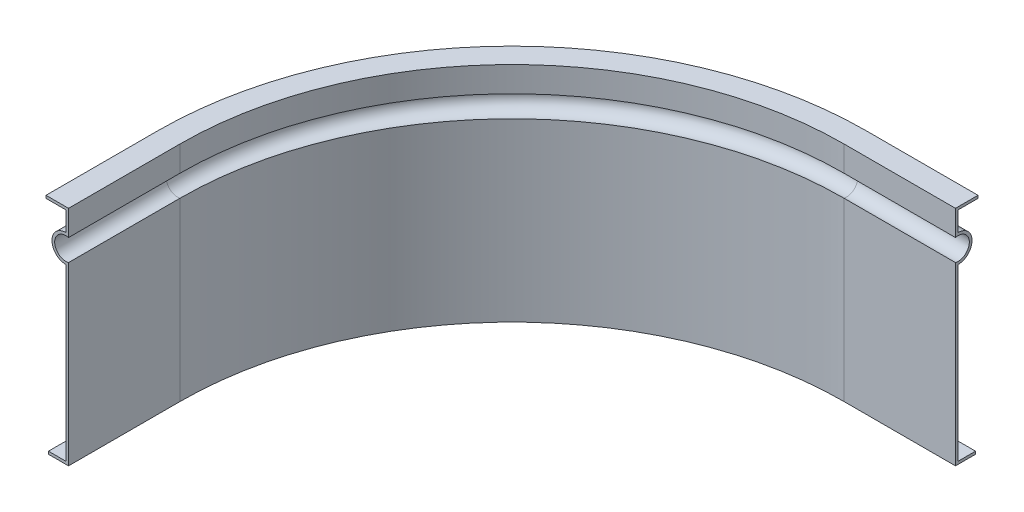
ISO-10303-21;
HEADER;
FILE_DESCRIPTION(('STEP AP214'),'2;1');
FILE_NAME('part.step','',(''),(''),'','','');
FILE_SCHEMA(('AUTOMOTIVE_DESIGN { 1 0 10303 214 1 1 1 1 }'));
ENDSEC;
DATA;
#1=APPLICATION_CONTEXT('core data for automotive mechanical design processes');
#2=APPLICATION_PROTOCOL_DEFINITION('international standard','automotive_design',2000,#1);
#3=PRODUCT_CONTEXT('',#1,'mechanical');
#4=PRODUCT('Part','Part','',(#3));
#5=PRODUCT_RELATED_PRODUCT_CATEGORY('part','',(#4));
#6=PRODUCT_DEFINITION_FORMATION('','',#4);
#7=PRODUCT_DEFINITION_CONTEXT('part definition',#1,'design');
#8=PRODUCT_DEFINITION('design','',#6,#7);
#9=PRODUCT_DEFINITION_SHAPE('','',#8);
#10=(LENGTH_UNIT() NAMED_UNIT(*) SI_UNIT(.MILLI.,.METRE.));
#11=(NAMED_UNIT(*) PLANE_ANGLE_UNIT() SI_UNIT($,.RADIAN.));
#12=(NAMED_UNIT(*) SI_UNIT($,.STERADIAN.) SOLID_ANGLE_UNIT());
#13=UNCERTAINTY_MEASURE_WITH_UNIT(LENGTH_MEASURE(1.E-05),#10,'distance_accuracy_value','');
#14=(GEOMETRIC_REPRESENTATION_CONTEXT(3) GLOBAL_UNCERTAINTY_ASSIGNED_CONTEXT((#13)) GLOBAL_UNIT_ASSIGNED_CONTEXT((#10,
#11,#12)) REPRESENTATION_CONTEXT('',''));
#15=CARTESIAN_POINT('',(0.,0.,0.));
#16=DIRECTION('',(0.,0.,1.));
#17=DIRECTION('',(1.,0.,0.));
#18=AXIS2_PLACEMENT_3D('',#15,#16,#17);
#19=CARTESIAN_POINT('',(147.572,77.7216181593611,-198.786));
#20=DIRECTION('',(0.,0.,-1.));
#21=DIRECTION('',(0.,1.,0.));
#22=AXIS2_PLACEMENT_3D('',#19,#20,#21);
#23=PLANE('',#22);
#24=DIRECTION('',(0.,1.,0.));
#25=VECTOR('',#24,1.);
#26=CARTESIAN_POINT('',(147.572,77.7216181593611,-198.786));
#27=LINE('',#26,#25);
#28=CARTESIAN_POINT('',(147.572,-1.214,-198.786));
#29=VERTEX_POINT('',#28);
#30=CARTESIAN_POINT('',(147.572,77.7216181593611,-198.786));
#31=VERTEX_POINT('',#30);
#32=EDGE_CURVE('E204',#29,#31,#27,.T.);
#33=ORIENTED_EDGE('',*,*,#32,.F.);
#34=DIRECTION('',(1.,0.,0.));
#35=VECTOR('',#34,1.);
#36=CARTESIAN_POINT('',(147.572,-1.214,-198.786));
#37=LINE('',#36,#35);
#38=CARTESIAN_POINT('',(197.572,-1.214,-198.786));
#39=VERTEX_POINT('',#38);
#40=EDGE_CURVE('E37',#29,#39,#37,.T.);
#41=ORIENTED_EDGE('',*,*,#40,.T.);
#42=DIRECTION('',(0.,1.,0.));
#43=VECTOR('',#42,1.);
#44=CARTESIAN_POINT('',(197.572,77.7216181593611,-198.786));
#45=LINE('',#44,#43);
#46=CARTESIAN_POINT('',(197.572,77.7216181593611,-198.786));
#47=VERTEX_POINT('',#46);
#48=EDGE_CURVE('E44',#39,#47,#45,.T.);
#49=ORIENTED_EDGE('',*,*,#48,.T.);
#50=DIRECTION('',(1.,0.,0.));
#51=VECTOR('',#50,1.);
#52=CARTESIAN_POINT('',(147.572,77.7216181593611,-198.786));
#53=LINE('',#52,#51);
#54=EDGE_CURVE('E11',#31,#47,#53,.T.);
#55=ORIENTED_EDGE('',*,*,#54,.F.);
#56=EDGE_LOOP('',(#33,#41,#49,#55));
#57=FACE_BOUND('',#56,.T.);
#58=ADVANCED_FACE('F30',(#57),#23,.F.);
#59=CARTESIAN_POINT('',(147.572,0.,-207.786));
#60=DIRECTION('',(0.,0.,1.));
#61=DIRECTION('',(1.,0.,0.));
#62=AXIS2_PLACEMENT_3D('',#59,#60,#61);
#63=PLANE('',#62);
#64=DIRECTION('',(0.,-1.,0.));
#65=VECTOR('',#64,1.);
#66=CARTESIAN_POINT('',(147.572,0.,-207.786));
#67=LINE('',#66,#65);
#68=CARTESIAN_POINT('',(147.572,0.,-207.786));
#69=VERTEX_POINT('',#68);
#70=CARTESIAN_POINT('',(147.572,-1.214,-207.786));
#71=VERTEX_POINT('',#70);
#72=EDGE_CURVE('E314',#69,#71,#67,.T.);
#73=ORIENTED_EDGE('',*,*,#72,.F.);
#74=DIRECTION('',(1.,0.,0.));
#75=VECTOR('',#74,1.);
#76=CARTESIAN_POINT('',(147.572,0.,-207.786));
#77=LINE('',#76,#75);
#78=CARTESIAN_POINT('',(197.572,0.,-207.786));
#79=VERTEX_POINT('',#78);
#80=EDGE_CURVE('E395',#69,#79,#77,.T.);
#81=ORIENTED_EDGE('',*,*,#80,.T.);
#82=DIRECTION('',(0.,-1.,0.));
#83=VECTOR('',#82,1.);
#84=CARTESIAN_POINT('',(197.572,0.,-207.786));
#85=LINE('',#84,#83);
#86=CARTESIAN_POINT('',(197.572,-1.214,-207.786));
#87=VERTEX_POINT('',#86);
#88=EDGE_CURVE('E367',#79,#87,#85,.T.);
#89=ORIENTED_EDGE('',*,*,#88,.T.);
#90=DIRECTION('',(1.,0.,0.));
#91=VECTOR('',#90,1.);
#92=CARTESIAN_POINT('',(147.572,-1.214,-207.786));
#93=LINE('',#92,#91);
#94=EDGE_CURVE('E398',#71,#87,#93,.T.);
#95=ORIENTED_EDGE('',*,*,#94,.F.);
#96=EDGE_LOOP('',(#73,#81,#89,#95));
#97=FACE_BOUND('',#96,.T.);
#98=ADVANCED_FACE('F421',(#97),#63,.F.);
#99=CARTESIAN_POINT('',(147.572,76.358,-200.));
#100=DIRECTION('',(0.,0.,1.));
#101=DIRECTION('',(0.,-1.,0.));
#102=AXIS2_PLACEMENT_3D('',#99,#100,#101);
#103=PLANE('',#102);
#104=DIRECTION('',(0.,-1.,0.));
#105=VECTOR('',#104,1.);
#106=CARTESIAN_POINT('',(147.572,76.358,-200.));
#107=LINE('',#106,#105);
#108=CARTESIAN_POINT('',(147.572,76.358,-200.));
#109=VERTEX_POINT('',#108);
#110=CARTESIAN_POINT('',(147.572,0.,-200.));
#111=VERTEX_POINT('',#110);
#112=EDGE_CURVE('E311',#109,#111,#107,.T.);
#113=ORIENTED_EDGE('',*,*,#112,.F.);
#114=DIRECTION('',(1.,0.,0.));
#115=VECTOR('',#114,1.);
#116=CARTESIAN_POINT('',(147.572,76.358,-200.));
#117=LINE('',#116,#115);
#118=CARTESIAN_POINT('',(197.572,76.358,-200.));
#119=VERTEX_POINT('',#118);
#120=EDGE_CURVE('E389',#109,#119,#117,.T.);
#121=ORIENTED_EDGE('',*,*,#120,.T.);
#122=DIRECTION('',(0.,-1.,0.));
#123=VECTOR('',#122,1.);
#124=CARTESIAN_POINT('',(197.572,76.358,-200.));
#125=LINE('',#124,#123);
#126=CARTESIAN_POINT('',(197.572,0.,-200.));
#127=VERTEX_POINT('',#126);
#128=EDGE_CURVE('E363',#119,#127,#125,.T.);
#129=ORIENTED_EDGE('',*,*,#128,.T.);
#130=DIRECTION('',(1.,0.,0.));
#131=VECTOR('',#130,1.);
#132=CARTESIAN_POINT('',(147.572,0.,-200.));
#133=LINE('',#132,#131);
#134=EDGE_CURVE('E392',#111,#127,#133,.T.);
#135=ORIENTED_EDGE('',*,*,#134,.F.);
#136=EDGE_LOOP('',(#113,#121,#129,#135));
#137=FACE_BOUND('',#136,.T.);
#138=ADVANCED_FACE('F469',(#137),#103,.F.);
#139=CARTESIAN_POINT('',(147.572,82.572,-200.));
#140=DIRECTION('',(1.,0.,0.));
#141=DIRECTION('',(0.,0.,-1.));
#142=AXIS2_PLACEMENT_3D('',#139,#140,#141);
#143=CYLINDRICAL_SURFACE('',#142,6.214);
#144=CARTESIAN_POINT('',(147.572,82.572,-200.));
#145=DIRECTION('',(-1.,0.,0.));
#146=DIRECTION('',(0.,0.,1.));
#147=AXIS2_PLACEMENT_3D('',#144,#145,#146);
#148=CIRCLE('',#147,6.214);
#149=CARTESIAN_POINT('',(147.572,88.786,-200.));
#150=VERTEX_POINT('',#149);
#151=EDGE_CURVE('E308',#150,#109,#148,.T.);
#152=ORIENTED_EDGE('',*,*,#151,.F.);
#153=DIRECTION('',(1.,0.,0.));
#154=VECTOR('',#153,1.);
#155=CARTESIAN_POINT('',(147.572,88.786,-200.));
#156=LINE('',#155,#154);
#157=CARTESIAN_POINT('',(197.572,88.786,-200.));
#158=VERTEX_POINT('',#157);
#159=EDGE_CURVE('E386',#150,#158,#156,.T.);
#160=ORIENTED_EDGE('',*,*,#159,.T.);
#161=CARTESIAN_POINT('',(197.572,82.572,-200.));
#162=DIRECTION('',(-1.,0.,0.));
#163=DIRECTION('',(0.,0.,1.));
#164=AXIS2_PLACEMENT_3D('',#161,#162,#163);
#165=CIRCLE('',#164,6.214);
#166=EDGE_CURVE('E361',#158,#119,#165,.T.);
#167=ORIENTED_EDGE('',*,*,#166,.T.);
#168=ORIENTED_EDGE('',*,*,#120,.F.);
#169=EDGE_LOOP('',(#152,#160,#167,#168));
#170=FACE_BOUND('',#169,.T.);
#171=ADVANCED_FACE('F472',(#170),#143,.T.);
#172=CARTESIAN_POINT('',(147.572,97.572,-200.));
#173=DIRECTION('',(0.,0.,1.));
#174=DIRECTION('',(0.,-1.,0.));
#175=AXIS2_PLACEMENT_3D('',#172,#173,#174);
#176=PLANE('',#175);
#177=DIRECTION('',(0.,-1.,0.));
#178=VECTOR('',#177,1.);
#179=CARTESIAN_POINT('',(147.572,97.572,-200.));
#180=LINE('',#179,#178);
#181=CARTESIAN_POINT('',(147.572,97.572,-200.));
#182=VERTEX_POINT('',#181);
#183=EDGE_CURVE('E305',#182,#150,#180,.T.);
#184=ORIENTED_EDGE('',*,*,#183,.F.);
#185=DIRECTION('',(1.,0.,0.));
#186=VECTOR('',#185,1.);
#187=CARTESIAN_POINT('',(147.572,97.572,-200.));
#188=LINE('',#187,#186);
#189=CARTESIAN_POINT('',(197.572,97.572,-200.));
#190=VERTEX_POINT('',#189);
#191=EDGE_CURVE('E383',#182,#190,#188,.T.);
#192=ORIENTED_EDGE('',*,*,#191,.T.);
#193=DIRECTION('',(0.,-1.,0.));
#194=VECTOR('',#193,1.);
#195=CARTESIAN_POINT('',(197.572,97.572,-200.));
#196=LINE('',#195,#194);
#197=EDGE_CURVE('E359',#190,#158,#196,.T.);
#198=ORIENTED_EDGE('',*,*,#197,.T.);
#199=ORIENTED_EDGE('',*,*,#159,.F.);
#200=EDGE_LOOP('',(#184,#192,#198,#199));
#201=FACE_BOUND('',#200,.T.);
#202=ADVANCED_FACE('F475',(#201),#176,.F.);
#203=CARTESIAN_POINT('',(147.572,98.786,-208.890059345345));
#204=DIRECTION('',(0.,0.,1.));
#205=DIRECTION('',(1.,0.,0.));
#206=AXIS2_PLACEMENT_3D('',#203,#204,#205);
#207=PLANE('',#206);
#208=DIRECTION('',(0.,-1.,0.));
#209=VECTOR('',#208,1.);
#210=CARTESIAN_POINT('',(147.572,98.786,-208.890059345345));
#211=LINE('',#210,#209);
#212=CARTESIAN_POINT('',(147.572,98.786,-208.890059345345));
#213=VERTEX_POINT('',#212);
#214=CARTESIAN_POINT('',(147.572,97.572,-208.890059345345));
#215=VERTEX_POINT('',#214);
#216=EDGE_CURVE('E302',#213,#215,#211,.T.);
#217=ORIENTED_EDGE('',*,*,#216,.F.);
#218=DIRECTION('',(1.,0.,0.));
#219=VECTOR('',#218,1.);
#220=CARTESIAN_POINT('',(147.572,98.786,-208.890059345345));
#221=LINE('',#220,#219);
#222=CARTESIAN_POINT('',(197.572,98.786,-208.890059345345));
#223=VERTEX_POINT('',#222);
#224=EDGE_CURVE('E377',#213,#223,#221,.T.);
#225=ORIENTED_EDGE('',*,*,#224,.T.);
#226=DIRECTION('',(0.,-1.,0.));
#227=VECTOR('',#226,1.);
#228=CARTESIAN_POINT('',(197.572,98.786,-208.890059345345));
#229=LINE('',#228,#227);
#230=CARTESIAN_POINT('',(197.572,97.572,-208.890059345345));
#231=VERTEX_POINT('',#230);
#232=EDGE_CURVE('E355',#223,#231,#229,.T.);
#233=ORIENTED_EDGE('',*,*,#232,.T.);
#234=DIRECTION('',(1.,0.,0.));
#235=VECTOR('',#234,1.);
#236=CARTESIAN_POINT('',(147.572,97.572,-208.890059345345));
#237=LINE('',#236,#235);
#238=EDGE_CURVE('E380',#215,#231,#237,.T.);
#239=ORIENTED_EDGE('',*,*,#238,.F.);
#240=EDGE_LOOP('',(#217,#225,#233,#239));
#241=FACE_BOUND('',#240,.T.);
#242=ADVANCED_FACE('F480',(#241),#207,.F.);
#243=CARTESIAN_POINT('',(147.572,98.786,-198.786));
#244=DIRECTION('',(0.,0.,-1.));
#245=DIRECTION('',(0.,1.,0.));
#246=AXIS2_PLACEMENT_3D('',#243,#244,#245);
#247=PLANE('',#246);
#248=DIRECTION('',(0.,1.,0.));
#249=VECTOR('',#248,1.);
#250=CARTESIAN_POINT('',(147.572,98.786,-198.786));
#251=LINE('',#250,#249);
#252=CARTESIAN_POINT('',(147.572,87.4223818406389,-198.786));
#253=VERTEX_POINT('',#252);
#254=CARTESIAN_POINT('',(147.572,98.786,-198.786));
#255=VERTEX_POINT('',#254);
#256=EDGE_CURVE('E300',#253,#255,#251,.T.);
#257=ORIENTED_EDGE('',*,*,#256,.F.);
#258=DIRECTION('',(1.,0.,0.));
#259=VECTOR('',#258,1.);
#260=CARTESIAN_POINT('',(147.572,87.4223818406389,-198.786));
#261=LINE('',#260,#259);
#262=CARTESIAN_POINT('',(197.572,87.4223818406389,-198.786));
#263=VERTEX_POINT('',#262);
#264=EDGE_CURVE('E371',#253,#263,#261,.T.);
#265=ORIENTED_EDGE('',*,*,#264,.T.);
#266=DIRECTION('',(0.,1.,0.));
#267=VECTOR('',#266,1.);
#268=CARTESIAN_POINT('',(197.572,98.786,-198.786));
#269=LINE('',#268,#267);
#270=CARTESIAN_POINT('',(197.572,98.786,-198.786));
#271=VERTEX_POINT('',#270);
#272=EDGE_CURVE('E351',#263,#271,#269,.T.);
#273=ORIENTED_EDGE('',*,*,#272,.T.);
#274=DIRECTION('',(1.,0.,0.));
#275=VECTOR('',#274,1.);
#276=CARTESIAN_POINT('',(147.572,98.786,-198.786));
#277=LINE('',#276,#275);
#278=EDGE_CURVE('E374',#255,#271,#277,.T.);
#279=ORIENTED_EDGE('',*,*,#278,.F.);
#280=EDGE_LOOP('',(#257,#265,#273,#279));
#281=FACE_BOUND('',#280,.T.);
#282=ADVANCED_FACE('F432',(#281),#247,.F.);
#283=CARTESIAN_POINT('',(147.572,82.572,-200.));
#284=DIRECTION('',(1.,0.,0.));
#285=DIRECTION('',(0.,0.,-1.));
#286=AXIS2_PLACEMENT_3D('',#283,#284,#285);
#287=CYLINDRICAL_SURFACE('',#286,5.);
#288=CARTESIAN_POINT('',(147.572,82.572,-200.));
#289=DIRECTION('',(1.,0.,0.));
#290=DIRECTION('',(0.,0.,1.));
#291=AXIS2_PLACEMENT_3D('',#288,#289,#290);
#292=CIRCLE('',#291,5.);
#293=EDGE_CURVE('E200',#31,#253,#292,.T.);
#294=ORIENTED_EDGE('',*,*,#293,.F.);
#295=ORIENTED_EDGE('',*,*,#54,.T.);
#296=CARTESIAN_POINT('',(197.572,82.572,-200.));
#297=DIRECTION('',(1.,0.,0.));
#298=DIRECTION('',(0.,0.,1.));
#299=AXIS2_PLACEMENT_3D('',#296,#297,#298);
#300=CIRCLE('',#299,5.);
#301=EDGE_CURVE('E349',#47,#263,#300,.T.);
#302=ORIENTED_EDGE('',*,*,#301,.T.);
#303=ORIENTED_EDGE('',*,*,#264,.F.);
#304=EDGE_LOOP('',(#294,#295,#302,#303));
#305=FACE_BOUND('',#304,.T.);
#306=ADVANCED_FACE('F429',(#305),#287,.F.);
#307=CARTESIAN_POINT('',(147.572,0.,-50.));
#308=DIRECTION('',(0.,-1.,0.));
#309=DIRECTION('',(0.,0.,-1.));
#310=AXIS2_PLACEMENT_3D('',#307,#308,#309);
#311=CYLINDRICAL_SURFACE('',#310,148.786);
#312=DIRECTION('',(0.,1.,0.));
#313=VECTOR('',#312,1.);
#314=CARTESIAN_POINT('',(-1.21400000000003,77.7216181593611,-50.));
#315=LINE('',#314,#313);
#316=CARTESIAN_POINT('',(-1.214,-1.214,-50.));
#317=VERTEX_POINT('',#316);
#318=CARTESIAN_POINT('',(-1.21400000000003,77.7216181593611,-50.));
#319=VERTEX_POINT('',#318);
#320=EDGE_CURVE('E224',#317,#319,#315,.T.);
#321=ORIENTED_EDGE('',*,*,#320,.F.);
#322=CARTESIAN_POINT('',(147.572,-1.214,-50.));
#323=DIRECTION('',(0.,-1.,0.));
#324=DIRECTION('',(0.,0.,-1.));
#325=AXIS2_PLACEMENT_3D('',#322,#323,#324);
#326=CIRCLE('',#325,148.786);
#327=EDGE_CURVE('E344',#317,#29,#326,.T.);
#328=ORIENTED_EDGE('',*,*,#327,.T.);
#329=ORIENTED_EDGE('',*,*,#32,.T.);
#330=CARTESIAN_POINT('',(147.572,77.7216181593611,-50.));
#331=DIRECTION('',(0.,-1.,0.));
#332=DIRECTION('',(0.,0.,-1.));
#333=AXIS2_PLACEMENT_3D('',#330,#331,#332);
#334=CIRCLE('',#333,148.786);
#335=EDGE_CURVE('E347',#319,#31,#334,.T.);
#336=ORIENTED_EDGE('',*,*,#335,.F.);
#337=EDGE_LOOP('',(#321,#328,#329,#336));
#338=FACE_BOUND('',#337,.T.);
#339=ADVANCED_FACE('F405',(#338),#311,.F.);
#340=CARTESIAN_POINT('',(147.572,0.,-50.));
#341=DIRECTION('',(0.,-1.,0.));
#342=DIRECTION('',(0.,0.,-1.));
#343=AXIS2_PLACEMENT_3D('',#340,#341,#342);
#344=CYLINDRICAL_SURFACE('',#343,157.786);
#345=DIRECTION('',(0.,-1.,0.));
#346=VECTOR('',#345,1.);
#347=CARTESIAN_POINT('',(-10.214,0.,-50.));
#348=LINE('',#347,#346);
#349=CARTESIAN_POINT('',(-10.214,0.,-50.));
#350=VERTEX_POINT('',#349);
#351=CARTESIAN_POINT('',(-10.214,-1.214,-50.));
#352=VERTEX_POINT('',#351);
#353=EDGE_CURVE('E246',#350,#352,#348,.T.);
#354=ORIENTED_EDGE('',*,*,#353,.F.);
#355=CARTESIAN_POINT('',(147.572,0.,-50.));
#356=DIRECTION('',(0.,-1.,0.));
#357=DIRECTION('',(0.,0.,-1.));
#358=AXIS2_PLACEMENT_3D('',#355,#356,#357);
#359=CIRCLE('',#358,157.786);
#360=EDGE_CURVE('E338',#350,#69,#359,.T.);
#361=ORIENTED_EDGE('',*,*,#360,.T.);
#362=ORIENTED_EDGE('',*,*,#72,.T.);
#363=CARTESIAN_POINT('',(147.572,-1.214,-50.));
#364=DIRECTION('',(0.,-1.,0.));
#365=DIRECTION('',(0.,0.,-1.));
#366=AXIS2_PLACEMENT_3D('',#363,#364,#365);
#367=CIRCLE('',#366,157.786);
#368=EDGE_CURVE('E341',#352,#71,#367,.T.);
#369=ORIENTED_EDGE('',*,*,#368,.F.);
#370=EDGE_LOOP('',(#354,#361,#362,#369));
#371=FACE_BOUND('',#370,.T.);
#372=ADVANCED_FACE('F418',(#371),#344,.T.);
#373=CARTESIAN_POINT('',(147.572,0.,-50.));
#374=DIRECTION('',(0.,-1.,0.));
#375=DIRECTION('',(0.,0.,-1.));
#376=AXIS2_PLACEMENT_3D('',#373,#374,#375);
#377=CYLINDRICAL_SURFACE('',#376,150.);
#378=DIRECTION('',(0.,-1.,0.));
#379=VECTOR('',#378,1.);
#380=CARTESIAN_POINT('',(-2.42800000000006,76.358,-50.));
#381=LINE('',#380,#379);
#382=CARTESIAN_POINT('',(-2.42800000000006,76.358,-50.));
#383=VERTEX_POINT('',#382);
#384=CARTESIAN_POINT('',(-2.42800000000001,0.,-50.));
#385=VERTEX_POINT('',#384);
#386=EDGE_CURVE('E243',#383,#385,#381,.T.);
#387=ORIENTED_EDGE('',*,*,#386,.F.);
#388=CARTESIAN_POINT('',(147.572,76.358,-50.));
#389=DIRECTION('',(0.,-1.,0.));
#390=DIRECTION('',(0.,0.,-1.));
#391=AXIS2_PLACEMENT_3D('',#388,#389,#390);
#392=CIRCLE('',#391,150.);
#393=EDGE_CURVE('E332',#383,#109,#392,.T.);
#394=ORIENTED_EDGE('',*,*,#393,.T.);
#395=ORIENTED_EDGE('',*,*,#112,.T.);
#396=CARTESIAN_POINT('',(147.572,0.,-50.));
#397=DIRECTION('',(0.,-1.,0.));
#398=DIRECTION('',(0.,0.,-1.));
#399=AXIS2_PLACEMENT_3D('',#396,#397,#398);
#400=CIRCLE('',#399,150.);
#401=EDGE_CURVE('E335',#385,#111,#400,.T.);
#402=ORIENTED_EDGE('',*,*,#401,.F.);
#403=EDGE_LOOP('',(#387,#394,#395,#402));
#404=FACE_BOUND('',#403,.T.);
#405=ADVANCED_FACE('F517',(#404),#377,.T.);
#406=CARTESIAN_POINT('',(147.572,82.572,-50.));
#407=DIRECTION('',(0.,-1.,0.));
#408=DIRECTION('',(0.,0.,-1.));
#409=AXIS2_PLACEMENT_3D('',#406,#407,#408);
#410=TOROIDAL_SURFACE('',#409,150.,6.214);
#411=CARTESIAN_POINT('',(-2.42800000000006,82.572,-50.));
#412=DIRECTION('',(0.,0.,1.));
#413=DIRECTION('',(1.,0.,0.));
#414=AXIS2_PLACEMENT_3D('',#411,#412,#413);
#415=CIRCLE('',#414,6.214);
#416=CARTESIAN_POINT('',(-2.42800000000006,88.786,-50.));
#417=VERTEX_POINT('',#416);
#418=EDGE_CURVE('E240',#417,#383,#415,.T.);
#419=ORIENTED_EDGE('',*,*,#418,.F.);
#420=CARTESIAN_POINT('',(147.572,88.786,-50.));
#421=DIRECTION('',(0.,-1.,0.));
#422=DIRECTION('',(0.,0.,-1.));
#423=AXIS2_PLACEMENT_3D('',#420,#421,#422);
#424=CIRCLE('',#423,150.);
#425=EDGE_CURVE('E329',#417,#150,#424,.T.);
#426=ORIENTED_EDGE('',*,*,#425,.T.);
#427=ORIENTED_EDGE('',*,*,#151,.T.);
#428=ORIENTED_EDGE('',*,*,#393,.F.);
#429=EDGE_LOOP('',(#419,#426,#427,#428));
#430=FACE_BOUND('',#429,.T.);
#431=ADVANCED_FACE('F491',(#430),#410,.T.);
#432=CARTESIAN_POINT('',(147.572,0.,-50.));
#433=DIRECTION('',(0.,-1.,0.));
#434=DIRECTION('',(0.,0.,-1.));
#435=AXIS2_PLACEMENT_3D('',#432,#433,#434);
#436=CYLINDRICAL_SURFACE('',#435,150.);
#437=DIRECTION('',(0.,-1.,0.));
#438=VECTOR('',#437,1.);
#439=CARTESIAN_POINT('',(-2.42800000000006,97.572,-50.));
#440=LINE('',#439,#438);
#441=CARTESIAN_POINT('',(-2.42800000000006,97.572,-50.));
#442=VERTEX_POINT('',#441);
#443=EDGE_CURVE('E237',#442,#417,#440,.T.);
#444=ORIENTED_EDGE('',*,*,#443,.F.);
#445=CARTESIAN_POINT('',(147.572,97.572,-50.));
#446=DIRECTION('',(0.,-1.,0.));
#447=DIRECTION('',(0.,0.,-1.));
#448=AXIS2_PLACEMENT_3D('',#445,#446,#447);
#449=CIRCLE('',#448,150.);
#450=EDGE_CURVE('E326',#442,#182,#449,.T.);
#451=ORIENTED_EDGE('',*,*,#450,.T.);
#452=ORIENTED_EDGE('',*,*,#183,.T.);
#453=ORIENTED_EDGE('',*,*,#425,.F.);
#454=EDGE_LOOP('',(#444,#451,#452,#453));
#455=FACE_BOUND('',#454,.T.);
#456=ADVANCED_FACE('F484',(#455),#436,.T.);
#457=CARTESIAN_POINT('',(147.572,0.,-50.));
#458=DIRECTION('',(0.,-1.,0.));
#459=DIRECTION('',(0.,0.,-1.));
#460=AXIS2_PLACEMENT_3D('',#457,#458,#459);
#461=CYLINDRICAL_SURFACE('',#460,158.890059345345);
#462=DIRECTION('',(0.,-1.,0.));
#463=VECTOR('',#462,1.);
#464=CARTESIAN_POINT('',(-11.3180593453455,98.786,-50.));
#465=LINE('',#464,#463);
#466=CARTESIAN_POINT('',(-11.3180593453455,98.786,-50.));
#467=VERTEX_POINT('',#466);
#468=CARTESIAN_POINT('',(-11.3180593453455,97.572,-50.));
#469=VERTEX_POINT('',#468);
#470=EDGE_CURVE('E213',#467,#469,#465,.T.);
#471=ORIENTED_EDGE('',*,*,#470,.F.);
#472=CARTESIAN_POINT('',(147.572,98.786,-50.));
#473=DIRECTION('',(0.,-1.,0.));
#474=DIRECTION('',(0.,0.,-1.));
#475=AXIS2_PLACEMENT_3D('',#472,#473,#474);
#476=CIRCLE('',#475,158.890059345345);
#477=EDGE_CURVE('E320',#467,#213,#476,.T.);
#478=ORIENTED_EDGE('',*,*,#477,.T.);
#479=ORIENTED_EDGE('',*,*,#216,.T.);
#480=CARTESIAN_POINT('',(147.572,97.572,-50.));
#481=DIRECTION('',(0.,-1.,0.));
#482=DIRECTION('',(0.,0.,-1.));
#483=AXIS2_PLACEMENT_3D('',#480,#481,#482);
#484=CIRCLE('',#483,158.890059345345);
#485=EDGE_CURVE('E323',#469,#215,#484,.T.);
#486=ORIENTED_EDGE('',*,*,#485,.F.);
#487=EDGE_LOOP('',(#471,#478,#479,#486));
#488=FACE_BOUND('',#487,.T.);
#489=ADVANCED_FACE('F482',(#488),#461,.T.);
#490=CARTESIAN_POINT('',(147.572,0.,-50.));
#491=DIRECTION('',(0.,-1.,0.));
#492=DIRECTION('',(0.,0.,-1.));
#493=AXIS2_PLACEMENT_3D('',#490,#491,#492);
#494=CYLINDRICAL_SURFACE('',#493,148.786);
#495=DIRECTION('',(0.,1.,0.));
#496=VECTOR('',#495,1.);
#497=CARTESIAN_POINT('',(-1.21400000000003,98.786,-50.));
#498=LINE('',#497,#496);
#499=CARTESIAN_POINT('',(-1.21400000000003,87.4223818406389,-50.));
#500=VERTEX_POINT('',#499);
#501=CARTESIAN_POINT('',(-1.21400000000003,98.786,-50.));
#502=VERTEX_POINT('',#501);
#503=EDGE_CURVE('E207',#500,#502,#498,.T.);
#504=ORIENTED_EDGE('',*,*,#503,.F.);
#505=CARTESIAN_POINT('',(147.572,87.4223818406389,-50.));
#506=DIRECTION('',(0.,-1.,0.));
#507=DIRECTION('',(0.,0.,-1.));
#508=AXIS2_PLACEMENT_3D('',#505,#506,#507);
#509=CIRCLE('',#508,148.786);
#510=EDGE_CURVE('E192',#500,#253,#509,.T.);
#511=ORIENTED_EDGE('',*,*,#510,.T.);
#512=ORIENTED_EDGE('',*,*,#256,.T.);
#513=CARTESIAN_POINT('',(147.572,98.786,-50.));
#514=DIRECTION('',(0.,-1.,0.));
#515=DIRECTION('',(0.,0.,-1.));
#516=AXIS2_PLACEMENT_3D('',#513,#514,#515);
#517=CIRCLE('',#516,148.786);
#518=EDGE_CURVE('E203',#502,#255,#517,.T.);
#519=ORIENTED_EDGE('',*,*,#518,.F.);
#520=EDGE_LOOP('',(#504,#511,#512,#519));
#521=FACE_BOUND('',#520,.T.);
#522=ADVANCED_FACE('F209',(#521),#494,.F.);
#523=CARTESIAN_POINT('',(147.572,82.572,-50.));
#524=DIRECTION('',(0.,-1.,0.));
#525=DIRECTION('',(0.,0.,-1.));
#526=AXIS2_PLACEMENT_3D('',#523,#524,#525);
#527=TOROIDAL_SURFACE('',#526,150.,5.);
#528=CARTESIAN_POINT('',(-2.42800000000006,82.572,-50.));
#529=DIRECTION('',(0.,0.,-1.));
#530=DIRECTION('',(1.,0.,0.));
#531=AXIS2_PLACEMENT_3D('',#528,#529,#530);
#532=CIRCLE('',#531,5.);
#533=EDGE_CURVE('E197',#319,#500,#532,.T.);
#534=ORIENTED_EDGE('',*,*,#533,.F.);
#535=ORIENTED_EDGE('',*,*,#335,.T.);
#536=ORIENTED_EDGE('',*,*,#293,.T.);
#537=ORIENTED_EDGE('',*,*,#510,.F.);
#538=EDGE_LOOP('',(#534,#535,#536,#537));
#539=FACE_BOUND('',#538,.T.);
#540=ADVANCED_FACE('F194',(#539),#527,.F.);
#541=CARTESIAN_POINT('',(-2.42800000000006,82.572,-50.));
#542=DIRECTION('',(0.,0.,1.));
#543=DIRECTION('',(1.,0.,0.));
#544=AXIS2_PLACEMENT_3D('',#541,#542,#543);
#545=CYLINDRICAL_SURFACE('',#544,5.);
#546=CARTESIAN_POINT('',(-2.42800000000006,82.572,0.));
#547=DIRECTION('',(0.,0.,-1.));
#548=DIRECTION('',(1.,0.,0.));
#549=AXIS2_PLACEMENT_3D('',#546,#547,#548);
#550=CIRCLE('',#549,5.);
#551=CARTESIAN_POINT('',(-1.21400000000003,77.7216181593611,0.));
#552=VERTEX_POINT('',#551);
#553=CARTESIAN_POINT('',(-1.21400000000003,87.4223818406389,0.));
#554=VERTEX_POINT('',#553);
#555=EDGE_CURVE('E250',#552,#554,#550,.T.);
#556=ORIENTED_EDGE('',*,*,#555,.F.);
#557=DIRECTION('',(0.,0.,1.));
#558=VECTOR('',#557,1.);
#559=CARTESIAN_POINT('',(-1.21400000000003,77.7216181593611,-50.));
#560=LINE('',#559,#558);
#561=EDGE_CURVE('E227',#319,#552,#560,.T.);
#562=ORIENTED_EDGE('',*,*,#561,.F.);
#563=ORIENTED_EDGE('',*,*,#533,.T.);
#564=DIRECTION('',(0.,0.,1.));
#565=VECTOR('',#564,1.);
#566=CARTESIAN_POINT('',(-1.21400000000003,87.4223818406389,-50.));
#567=LINE('',#566,#565);
#568=EDGE_CURVE('E216',#500,#554,#567,.T.);
#569=ORIENTED_EDGE('',*,*,#568,.T.);
#570=EDGE_LOOP('',(#556,#562,#563,#569));
#571=FACE_BOUND('',#570,.T.);
#572=ADVANCED_FACE('F226',(#571),#545,.F.);
#573=CARTESIAN_POINT('',(-1.21400000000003,77.7216181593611,-50.));
#574=DIRECTION('',(1.,0.,0.));
#575=DIRECTION('',(0.,1.,0.));
#576=AXIS2_PLACEMENT_3D('',#573,#574,#575);
#577=PLANE('',#576);
#578=DIRECTION('',(0.,1.,0.));
#579=VECTOR('',#578,1.);
#580=CARTESIAN_POINT('',(-1.21400000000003,77.7216181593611,0.));
#581=LINE('',#580,#579);
#582=CARTESIAN_POINT('',(-1.214,-1.214,0.));
#583=VERTEX_POINT('',#582);
#584=EDGE_CURVE('E229',#583,#552,#581,.T.);
#585=ORIENTED_EDGE('',*,*,#584,.F.);
#586=DIRECTION('',(0.,0.,1.));
#587=VECTOR('',#586,1.);
#588=CARTESIAN_POINT('',(-1.214,-1.214,-50.));
#589=LINE('',#588,#587);
#590=EDGE_CURVE('E280',#317,#583,#589,.T.);
#591=ORIENTED_EDGE('',*,*,#590,.F.);
#592=ORIENTED_EDGE('',*,*,#320,.T.);
#593=ORIENTED_EDGE('',*,*,#561,.T.);
#594=EDGE_LOOP('',(#585,#591,#592,#593));
#595=FACE_BOUND('',#594,.T.);
#596=ADVANCED_FACE('F408',(#595),#577,.T.);
#597=CARTESIAN_POINT('',(-10.214,-1.214,-50.));
#598=DIRECTION('',(0.,-1.,0.));
#599=DIRECTION('',(0.,0.,-1.));
#600=AXIS2_PLACEMENT_3D('',#597,#598,#599);
#601=PLANE('',#600);
#602=DIRECTION('',(1.,0.,0.));
#603=VECTOR('',#602,1.);
#604=CARTESIAN_POINT('',(-10.214,-1.214,0.));
#605=LINE('',#604,#603);
#606=CARTESIAN_POINT('',(-10.214,-1.214,0.));
#607=VERTEX_POINT('',#606);
#608=EDGE_CURVE('E232',#607,#583,#605,.T.);
#609=ORIENTED_EDGE('',*,*,#608,.F.);
#610=DIRECTION('',(0.,0.,1.));
#611=VECTOR('',#610,1.);
#612=CARTESIAN_POINT('',(-10.214,-1.214,-50.));
#613=LINE('',#612,#611);
#614=EDGE_CURVE('E282',#352,#607,#613,.T.);
#615=ORIENTED_EDGE('',*,*,#614,.F.);
#616=ORIENTED_EDGE('',*,*,#368,.T.);
#617=ORIENTED_EDGE('',*,*,#94,.T.);
#618=DIRECTION('',(0.,0.,1.));
#619=VECTOR('',#618,1.);
#620=CARTESIAN_POINT('',(197.572,-1.214,-207.786));
#621=LINE('',#620,#619);
#622=EDGE_CURVE('E52',#87,#39,#621,.T.);
#623=ORIENTED_EDGE('',*,*,#622,.T.);
#624=ORIENTED_EDGE('',*,*,#40,.F.);
#625=ORIENTED_EDGE('',*,*,#327,.F.);
#626=ORIENTED_EDGE('',*,*,#590,.T.);
#627=EDGE_LOOP('',(#609,#615,#616,#617,#623,#624,#625,#626));
#628=FACE_BOUND('',#627,.T.);
#629=ADVANCED_FACE('F401',(#628),#601,.T.);
#630=CARTESIAN_POINT('',(-10.214,0.,-50.));
#631=DIRECTION('',(-1.,0.,0.));
#632=DIRECTION('',(0.,0.,1.));
#633=AXIS2_PLACEMENT_3D('',#630,#631,#632);
#634=PLANE('',#633);
#635=DIRECTION('',(0.,-1.,0.));
#636=VECTOR('',#635,1.);
#637=CARTESIAN_POINT('',(-10.214,0.,0.));
#638=LINE('',#637,#636);
#639=CARTESIAN_POINT('',(-10.214,0.,0.));
#640=VERTEX_POINT('',#639);
#641=EDGE_CURVE('E274',#640,#607,#638,.T.);
#642=ORIENTED_EDGE('',*,*,#641,.F.);
#643=DIRECTION('',(0.,0.,1.));
#644=VECTOR('',#643,1.);
#645=CARTESIAN_POINT('',(-10.214,0.,-50.));
#646=LINE('',#645,#644);
#647=EDGE_CURVE('E284',#350,#640,#646,.T.);
#648=ORIENTED_EDGE('',*,*,#647,.F.);
#649=ORIENTED_EDGE('',*,*,#353,.T.);
#650=ORIENTED_EDGE('',*,*,#614,.T.);
#651=EDGE_LOOP('',(#642,#648,#649,#650));
#652=FACE_BOUND('',#651,.T.);
#653=ADVANCED_FACE('F416',(#652),#634,.T.);
#654=CARTESIAN_POINT('',(-2.42800000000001,0.,-50.));
#655=DIRECTION('',(0.,1.,0.));
#656=DIRECTION('',(0.,0.,1.));
#657=AXIS2_PLACEMENT_3D('',#654,#655,#656);
#658=PLANE('',#657);
#659=DIRECTION('',(-1.,0.,0.));
#660=VECTOR('',#659,1.);
#661=CARTESIAN_POINT('',(-2.42800000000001,0.,0.));
#662=LINE('',#661,#660);
#663=CARTESIAN_POINT('',(-2.42800000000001,0.,0.));
#664=VERTEX_POINT('',#663);
#665=EDGE_CURVE('E271',#664,#640,#662,.T.);
#666=ORIENTED_EDGE('',*,*,#665,.F.);
#667=DIRECTION('',(0.,0.,1.));
#668=VECTOR('',#667,1.);
#669=CARTESIAN_POINT('',(-2.42800000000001,0.,-50.));
#670=LINE('',#669,#668);
#671=EDGE_CURVE('E286',#385,#664,#670,.T.);
#672=ORIENTED_EDGE('',*,*,#671,.F.);
#673=ORIENTED_EDGE('',*,*,#401,.T.);
#674=ORIENTED_EDGE('',*,*,#134,.T.);
#675=DIRECTION('',(0.,0.,-1.));
#676=VECTOR('',#675,1.);
#677=CARTESIAN_POINT('',(197.572,0.,-200.));
#678=LINE('',#677,#676);
#679=EDGE_CURVE('E365',#127,#79,#678,.T.);
#680=ORIENTED_EDGE('',*,*,#679,.T.);
#681=ORIENTED_EDGE('',*,*,#80,.F.);
#682=ORIENTED_EDGE('',*,*,#360,.F.);
#683=ORIENTED_EDGE('',*,*,#647,.T.);
#684=EDGE_LOOP('',(#666,#672,#673,#674,#680,#681,#682,#683));
#685=FACE_BOUND('',#684,.T.);
#686=ADVANCED_FACE('F463',(#685),#658,.T.);
#687=CARTESIAN_POINT('',(-2.42800000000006,76.358,-50.));
#688=DIRECTION('',(-1.,0.,0.));
#689=DIRECTION('',(0.,-1.,0.));
#690=AXIS2_PLACEMENT_3D('',#687,#688,#689);
#691=PLANE('',#690);
#692=DIRECTION('',(0.,-1.,0.));
#693=VECTOR('',#692,1.);
#694=CARTESIAN_POINT('',(-2.42800000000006,76.358,0.));
#695=LINE('',#694,#693);
#696=CARTESIAN_POINT('',(-2.42800000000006,76.358,0.));
#697=VERTEX_POINT('',#696);
#698=EDGE_CURVE('E268',#697,#664,#695,.T.);
#699=ORIENTED_EDGE('',*,*,#698,.F.);
#700=DIRECTION('',(0.,0.,1.));
#701=VECTOR('',#700,1.);
#702=CARTESIAN_POINT('',(-2.42800000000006,76.358,-50.));
#703=LINE('',#702,#701);
#704=EDGE_CURVE('E288',#383,#697,#703,.T.);
#705=ORIENTED_EDGE('',*,*,#704,.F.);
#706=ORIENTED_EDGE('',*,*,#386,.T.);
#707=ORIENTED_EDGE('',*,*,#671,.T.);
#708=EDGE_LOOP('',(#699,#705,#706,#707));
#709=FACE_BOUND('',#708,.T.);
#710=ADVANCED_FACE('F458',(#709),#691,.T.);
#711=CARTESIAN_POINT('',(-2.42800000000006,82.572,-50.));
#712=DIRECTION('',(0.,0.,1.));
#713=DIRECTION('',(1.,0.,0.));
#714=AXIS2_PLACEMENT_3D('',#711,#712,#713);
#715=CYLINDRICAL_SURFACE('',#714,6.214);
#716=CARTESIAN_POINT('',(-2.42800000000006,82.572,0.));
#717=DIRECTION('',(0.,0.,1.));
#718=DIRECTION('',(1.,0.,0.));
#719=AXIS2_PLACEMENT_3D('',#716,#717,#718);
#720=CIRCLE('',#719,6.214);
#721=CARTESIAN_POINT('',(-2.42800000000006,88.786,0.));
#722=VERTEX_POINT('',#721);
#723=EDGE_CURVE('E265',#722,#697,#720,.T.);
#724=ORIENTED_EDGE('',*,*,#723,.F.);
#725=DIRECTION('',(0.,0.,1.));
#726=VECTOR('',#725,1.);
#727=CARTESIAN_POINT('',(-2.42800000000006,88.786,-50.));
#728=LINE('',#727,#726);
#729=EDGE_CURVE('E290',#417,#722,#728,.T.);
#730=ORIENTED_EDGE('',*,*,#729,.F.);
#731=ORIENTED_EDGE('',*,*,#418,.T.);
#732=ORIENTED_EDGE('',*,*,#704,.T.);
#733=EDGE_LOOP('',(#724,#730,#731,#732));
#734=FACE_BOUND('',#733,.T.);
#735=ADVANCED_FACE('F454',(#734),#715,.T.);
#736=CARTESIAN_POINT('',(-2.42800000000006,97.572,-50.));
#737=DIRECTION('',(-1.,0.,0.));
#738=DIRECTION('',(0.,-1.,0.));
#739=AXIS2_PLACEMENT_3D('',#736,#737,#738);
#740=PLANE('',#739);
#741=DIRECTION('',(0.,-1.,0.));
#742=VECTOR('',#741,1.);
#743=CARTESIAN_POINT('',(-2.42800000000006,97.572,0.));
#744=LINE('',#743,#742);
#745=CARTESIAN_POINT('',(-2.42800000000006,97.572,0.));
#746=VERTEX_POINT('',#745);
#747=EDGE_CURVE('E262',#746,#722,#744,.T.);
#748=ORIENTED_EDGE('',*,*,#747,.F.);
#749=DIRECTION('',(0.,0.,1.));
#750=VECTOR('',#749,1.);
#751=CARTESIAN_POINT('',(-2.42800000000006,97.572,-50.));
#752=LINE('',#751,#750);
#753=EDGE_CURVE('E292',#442,#746,#752,.T.);
#754=ORIENTED_EDGE('',*,*,#753,.F.);
#755=ORIENTED_EDGE('',*,*,#443,.T.);
#756=ORIENTED_EDGE('',*,*,#729,.T.);
#757=EDGE_LOOP('',(#748,#754,#755,#756));
#758=FACE_BOUND('',#757,.T.);
#759=ADVANCED_FACE('F449',(#758),#740,.T.);
#760=CARTESIAN_POINT('',(-11.3180593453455,97.572,-50.));
#761=DIRECTION('',(0.,-1.,0.));
#762=DIRECTION('',(0.,0.,-1.));
#763=AXIS2_PLACEMENT_3D('',#760,#761,#762);
#764=PLANE('',#763);
#765=DIRECTION('',(1.,0.,0.));
#766=VECTOR('',#765,1.);
#767=CARTESIAN_POINT('',(-11.3180593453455,97.572,0.));
#768=LINE('',#767,#766);
#769=CARTESIAN_POINT('',(-11.3180593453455,97.572,0.));
#770=VERTEX_POINT('',#769);
#771=EDGE_CURVE('E259',#770,#746,#768,.T.);
#772=ORIENTED_EDGE('',*,*,#771,.F.);
#773=DIRECTION('',(0.,0.,1.));
#774=VECTOR('',#773,1.);
#775=CARTESIAN_POINT('',(-11.3180593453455,97.572,-50.));
#776=LINE('',#775,#774);
#777=EDGE_CURVE('E294',#469,#770,#776,.T.);
#778=ORIENTED_EDGE('',*,*,#777,.F.);
#779=ORIENTED_EDGE('',*,*,#485,.T.);
#780=ORIENTED_EDGE('',*,*,#238,.T.);
#781=DIRECTION('',(0.,0.,1.));
#782=VECTOR('',#781,1.);
#783=CARTESIAN_POINT('',(197.572,97.572,-208.890059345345));
#784=LINE('',#783,#782);
#785=EDGE_CURVE('E357',#231,#190,#784,.T.);
#786=ORIENTED_EDGE('',*,*,#785,.T.);
#787=ORIENTED_EDGE('',*,*,#191,.F.);
#788=ORIENTED_EDGE('',*,*,#450,.F.);
#789=ORIENTED_EDGE('',*,*,#753,.T.);
#790=EDGE_LOOP('',(#772,#778,#779,#780,#786,#787,#788,#789));
#791=FACE_BOUND('',#790,.T.);
#792=ADVANCED_FACE('F444',(#791),#764,.T.);
#793=CARTESIAN_POINT('',(-11.3180593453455,98.786,-50.));
#794=DIRECTION('',(-1.,0.,0.));
#795=DIRECTION('',(0.,0.,1.));
#796=AXIS2_PLACEMENT_3D('',#793,#794,#795);
#797=PLANE('',#796);
#798=DIRECTION('',(0.,-1.,0.));
#799=VECTOR('',#798,1.);
#800=CARTESIAN_POINT('',(-11.3180593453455,98.786,0.));
#801=LINE('',#800,#799);
#802=CARTESIAN_POINT('',(-11.3180593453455,98.786,0.));
#803=VERTEX_POINT('',#802);
#804=EDGE_CURVE('E256',#803,#770,#801,.T.);
#805=ORIENTED_EDGE('',*,*,#804,.F.);
#806=DIRECTION('',(0.,0.,1.));
#807=VECTOR('',#806,1.);
#808=CARTESIAN_POINT('',(-11.3180593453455,98.786,-50.));
#809=LINE('',#808,#807);
#810=EDGE_CURVE('E296',#467,#803,#809,.T.);
#811=ORIENTED_EDGE('',*,*,#810,.F.);
#812=ORIENTED_EDGE('',*,*,#470,.T.);
#813=ORIENTED_EDGE('',*,*,#777,.T.);
#814=EDGE_LOOP('',(#805,#811,#812,#813));
#815=FACE_BOUND('',#814,.T.);
#816=ADVANCED_FACE('F440',(#815),#797,.T.);
#817=CARTESIAN_POINT('',(-1.21400000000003,98.786,-50.));
#818=DIRECTION('',(0.,1.,0.));
#819=DIRECTION('',(0.,0.,1.));
#820=AXIS2_PLACEMENT_3D('',#817,#818,#819);
#821=PLANE('',#820);
#822=DIRECTION('',(-1.,0.,0.));
#823=VECTOR('',#822,1.);
#824=CARTESIAN_POINT('',(-1.21400000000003,98.786,0.));
#825=LINE('',#824,#823);
#826=CARTESIAN_POINT('',(-1.21400000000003,98.786,0.));
#827=VERTEX_POINT('',#826);
#828=EDGE_CURVE('E253',#827,#803,#825,.T.);
#829=ORIENTED_EDGE('',*,*,#828,.F.);
#830=DIRECTION('',(0.,0.,1.));
#831=VECTOR('',#830,1.);
#832=CARTESIAN_POINT('',(-1.21400000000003,98.786,-50.));
#833=LINE('',#832,#831);
#834=EDGE_CURVE('E223',#502,#827,#833,.T.);
#835=ORIENTED_EDGE('',*,*,#834,.F.);
#836=ORIENTED_EDGE('',*,*,#518,.T.);
#837=ORIENTED_EDGE('',*,*,#278,.T.);
#838=DIRECTION('',(0.,0.,-1.));
#839=VECTOR('',#838,1.);
#840=CARTESIAN_POINT('',(197.572,98.786,-198.786));
#841=LINE('',#840,#839);
#842=EDGE_CURVE('E353',#271,#223,#841,.T.);
#843=ORIENTED_EDGE('',*,*,#842,.T.);
#844=ORIENTED_EDGE('',*,*,#224,.F.);
#845=ORIENTED_EDGE('',*,*,#477,.F.);
#846=ORIENTED_EDGE('',*,*,#810,.T.);
#847=EDGE_LOOP('',(#829,#835,#836,#837,#843,#844,#845,#846));
#848=FACE_BOUND('',#847,.T.);
#849=ADVANCED_FACE('F435',(#848),#821,.T.);
#850=CARTESIAN_POINT('',(-1.21400000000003,98.786,-50.));
#851=DIRECTION('',(1.,0.,0.));
#852=DIRECTION('',(0.,1.,0.));
#853=AXIS2_PLACEMENT_3D('',#850,#851,#852);
#854=PLANE('',#853);
#855=DIRECTION('',(0.,1.,0.));
#856=VECTOR('',#855,1.);
#857=CARTESIAN_POINT('',(-1.21400000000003,98.786,0.));
#858=LINE('',#857,#856);
#859=EDGE_CURVE('E219',#554,#827,#858,.T.);
#860=ORIENTED_EDGE('',*,*,#859,.F.);
#861=ORIENTED_EDGE('',*,*,#568,.F.);
#862=ORIENTED_EDGE('',*,*,#503,.T.);
#863=ORIENTED_EDGE('',*,*,#834,.T.);
#864=EDGE_LOOP('',(#860,#861,#862,#863));
#865=FACE_BOUND('',#864,.T.);
#866=ADVANCED_FACE('F217',(#865),#854,.T.);
#867=CARTESIAN_POINT('',(197.572,82.572,-200.));
#868=DIRECTION('',(-1.,0.,0.));
#869=DIRECTION('',(0.,0.,1.));
#870=AXIS2_PLACEMENT_3D('',#867,#868,#869);
#871=PLANE('',#870);
#872=ORIENTED_EDGE('',*,*,#301,.F.);
#873=ORIENTED_EDGE('',*,*,#48,.F.);
#874=ORIENTED_EDGE('',*,*,#622,.F.);
#875=ORIENTED_EDGE('',*,*,#88,.F.);
#876=ORIENTED_EDGE('',*,*,#679,.F.);
#877=ORIENTED_EDGE('',*,*,#128,.F.);
#878=ORIENTED_EDGE('',*,*,#166,.F.);
#879=ORIENTED_EDGE('',*,*,#197,.F.);
#880=ORIENTED_EDGE('',*,*,#785,.F.);
#881=ORIENTED_EDGE('',*,*,#232,.F.);
#882=ORIENTED_EDGE('',*,*,#842,.F.);
#883=ORIENTED_EDGE('',*,*,#272,.F.);
#884=EDGE_LOOP('',(#872,#873,#874,#875,#876,#877,#878,#879,#880,#881,#882,#883));
#885=FACE_BOUND('',#884,.T.);
#886=ADVANCED_FACE('F425',(#885),#871,.F.);
#887=CARTESIAN_POINT('',(-2.42800000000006,82.572,0.));
#888=DIRECTION('',(0.,0.,1.));
#889=DIRECTION('',(1.,0.,0.));
#890=AXIS2_PLACEMENT_3D('',#887,#888,#889);
#891=PLANE('',#890);
#892=ORIENTED_EDGE('',*,*,#555,.T.);
#893=ORIENTED_EDGE('',*,*,#859,.T.);
#894=ORIENTED_EDGE('',*,*,#828,.T.);
#895=ORIENTED_EDGE('',*,*,#804,.T.);
#896=ORIENTED_EDGE('',*,*,#771,.T.);
#897=ORIENTED_EDGE('',*,*,#747,.T.);
#898=ORIENTED_EDGE('',*,*,#723,.T.);
#899=ORIENTED_EDGE('',*,*,#698,.T.);
#900=ORIENTED_EDGE('',*,*,#665,.T.);
#901=ORIENTED_EDGE('',*,*,#641,.T.);
#902=ORIENTED_EDGE('',*,*,#608,.T.);
#903=ORIENTED_EDGE('',*,*,#584,.T.);
#904=EDGE_LOOP('',(#892,#893,#894,#895,#896,#897,#898,#899,#900,#901,#902,#903));
#905=FACE_BOUND('',#904,.T.);
#906=ADVANCED_FACE('F410',(#905),#891,.T.);
#907=CLOSED_SHELL('',(#58,#98,#138,#171,#202,#242,#282,#306,#339,#372,#405,#431,#456,#489,#522,
#540,#572,#596,#629,#653,#686,#710,#735,#759,#792,#816,#849,#866,#886,#906));
#908=MANIFOLD_SOLID_BREP('B2',#907);
#909=ADVANCED_BREP_SHAPE_REPRESENTATION('',(#18,#908),#14);
#910=SHAPE_DEFINITION_REPRESENTATION(#9,#909);
ENDSEC;
END-ISO-10303-21;
